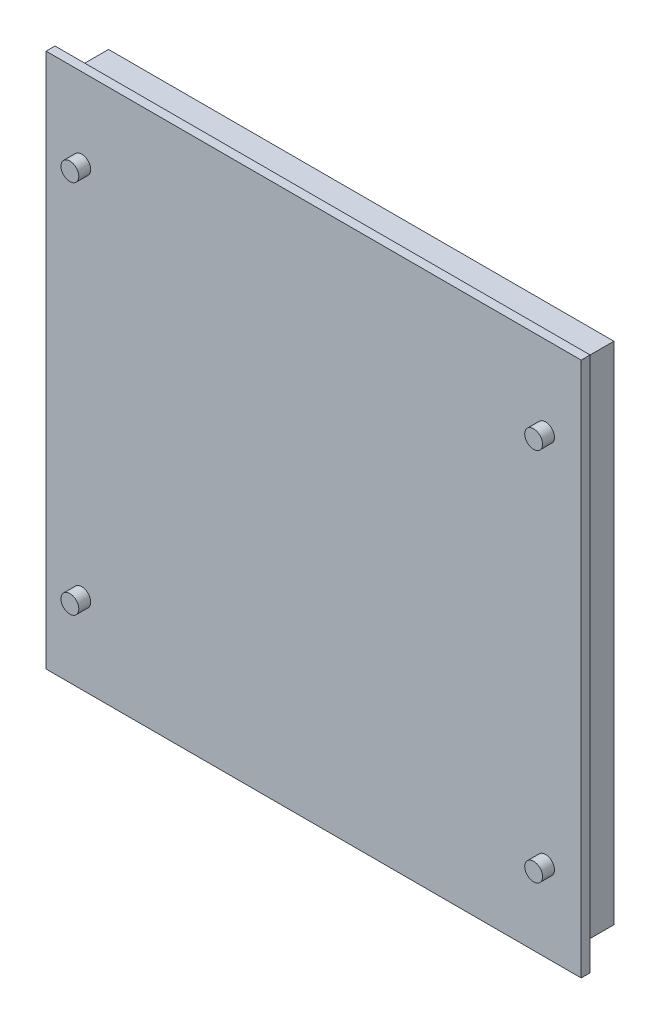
from build123d import *

# Parameters (mm, degrees)
SKETCH_1_W          = 180
SKETCH_1_H          = 180
EXTRUDE_1_DEPTH     = 3
SKETCH_2_R          = 3
EXTRUDE_2_DEPTH     = 4
SKETCH_3_W          = 170
SKETCH_3_H          = 170
EXTRUDE_3_DEPTH     = 13
CUT_EXTRUDE_1_DEPTH = 5


with BuildPart() as part:
    # Sketch 1 → Extrude 1 (new body)
    with BuildSketch(Plane.XY):
        Rectangle(SKETCH_1_W, SKETCH_1_H)
    extrude(amount=EXTRUDE_1_DEPTH)

    # Sketch 2 → Extrude 2 (add)
    with BuildSketch(Plane.XY.offset(3)):
        with Locations((-78, 63)):
            Circle(SKETCH_2_R)
        with Locations((-78, -63)):
            Circle(SKETCH_2_R)
        with Locations((78, -63)):
            Circle(SKETCH_2_R)
        with Locations((78, 63)):
            Circle(SKETCH_2_R)
    extrude(amount=EXTRUDE_2_DEPTH)

    # Sketch 3 → Extrude 3 (add)
    with BuildSketch(Plane(origin=(0, 0, 0), x_dir=(-1, 0, 0), z_dir=(0, 0, -1))):
        Rectangle(SKETCH_3_W, SKETCH_3_H)
    extrude(amount=EXTRUDE_3_DEPTH)

    # Sketch 4 → Cut-Extrude 1 (cut)
    with BuildSketch(Plane(origin=(0, 0, -13), x_dir=(-1, 0, 0), z_dir=(0, 0, -1))):
        Polygon((-6.788114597, 3.296117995), (-11.46647717, 3.296117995), (-11.46647717, -14.481659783), (-14.156535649, -14.481659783), (-14.156535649, 3.296117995), (-18.834898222, 3.296117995), (-18.834898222, 5.518340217), (-6.788114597, 5.518340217), align=None)
        Polygon((8.884400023, -14.481659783), (6.077382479, -14.481659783), (2.100774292, -6.29452528), (-1.875833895, -14.481659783), (-4.682851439, -14.481659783), (0.814224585, -3.955343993), (-4.098056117, 5.518340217), (-1.291038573, 5.518340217), (2.100774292, -1.733121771), (5.492587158, 5.518340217), (8.299604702, 5.518340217), (3.387324, -3.955343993), align=None)
        with BuildLine():
            add(Edge.make_bspline(
                [(11.22358131, -13.896864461), (11.237729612, -13.751990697), (11.265850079, -13.464046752), (11.364592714, -13.040443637), (11.503530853, -12.626856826), (11.686319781, -12.223471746), (11.912017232, -11.830124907), (12.18963069, -11.455144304), (12.49963509, -11.082002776), (12.870373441, -10.729319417), (13.270111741, -10.354063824), (13.684154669, -9.924537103), (14.132620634, -9.455598), (14.597338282, -8.92726201), (15.097929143, -8.358528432), (15.615137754, -7.732593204), (16.161317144, -7.061428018), (16.721139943, -6.357511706), (17.269747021, -5.650514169), (17.775303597, -4.965328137), (18.235066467, -4.325553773), (18.645325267, -3.728932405), (18.995148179, -3.168590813), (19.29893569, -2.653224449), (19.558147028, -2.183765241), (19.816814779, -1.623074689), (20.060945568, -0.97645104), (20.252370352, -0.241867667), (20.33935665, 0.437979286), (20.305160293, 1.062713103), (20.170874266, 1.632826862), (19.936253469, 2.150053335), (19.606998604, 2.616229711), (19.186045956, 3.013928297), (18.706210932, 3.341352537), (18.172238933, 3.561347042), (17.60089394, 3.672526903), (17.003161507, 3.662468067), (16.400669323, 3.555352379), (15.800458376, 3.369166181), (15.221849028, 3.080879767), (14.654998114, 2.721231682), (14.12980547, 2.25789624), (13.668189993, 1.687317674), (13.275501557, 1.012402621), (13.079588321, 0.513806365), (12.977967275, 0.255182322)],
                knots=[0, 0, 0, 0, 0.683264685, 1.358023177, 2.0380809, 2.730345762, 3.435487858, 4.164189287, 4.919895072, 5.711413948, 6.565494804, 7.49616148, 8.513531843, 9.613812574, 10.80147361, 12.073102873, 13.428218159, 14.866997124, 16.298560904, 17.632315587, 18.867297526, 20.000038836, 21.033387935, 21.969994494, 22.810824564, 23.551397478, 24.869445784, 26.052467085, 27.111050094, 28.075902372, 28.975949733, 29.847314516, 30.728213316, 31.639844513, 32.554273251, 33.442456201, 34.333871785, 35.270085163, 36.233696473, 37.201335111, 38.211692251, 39.261697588, 40.347896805, 41.485826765, 42.695887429, 44, 44, 44, 44], degree=3))
            Line((12.977967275, 0.255182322), (10.755745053, 0.606059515))
            add(Edge.make_bspline(
                [(10.755745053, 0.606059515), (10.834203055, 0.823591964), (10.986848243, 1.246815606), (11.249697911, 1.84946558), (11.521227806, 2.410454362), (11.808890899, 2.926064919), (12.118927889, 3.392616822), (12.443818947, 3.814645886), (12.785011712, 4.192095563), (13.143817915, 4.524524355), (13.519005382, 4.817576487), (13.913150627, 5.071720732), (14.321345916, 5.293722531), (14.745196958, 5.482132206), (15.185619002, 5.633971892), (15.644570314, 5.744391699), (16.117356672, 5.83005537), (16.440196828, 5.856051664), (16.603698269, 5.86921741)],
                knots=[0, 0, 0, 0, 1.318688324, 2.565594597, 3.747971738, 4.872722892, 5.930337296, 6.940181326, 7.908044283, 8.828858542, 9.726735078, 10.619953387, 11.500744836, 12.374616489, 13.262770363, 14.15366946, 15.064931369, 16, 16, 16, 16], degree=3))
            add(Edge.make_bspline(
                [(16.603698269, 5.86921741), (16.794162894, 5.884493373), (17.164579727, 5.914202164), (17.707497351, 5.919795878), (18.219862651, 5.884360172), (18.71074123, 5.817061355), (19.190304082, 5.698092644), (19.670905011, 5.52254544), (20.157089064, 5.28527392), (20.648065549, 4.994257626), (21.129337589, 4.638011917), (21.565054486, 4.190052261), (21.949556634, 3.65905161), (22.293099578, 3.058360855), (22.570394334, 2.383003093), (22.737159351, 1.630756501), (22.798311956, 0.814747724), (22.764710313, 0.094973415), (22.682858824, -0.514091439), (22.568175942, -1.000867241), (22.402898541, -1.507601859), (22.208302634, -2.042143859), (21.949900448, -2.591816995), (21.659050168, -3.168420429), (21.311239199, -3.761500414), (20.995603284, -4.27389208), (20.709633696, -4.70051639), (20.470109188, -5.048644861), (20.208442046, -5.420255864), (19.914742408, -5.809440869), (19.604558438, -6.225123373), (19.27090148, -6.663712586), (18.910867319, -7.121406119), (18.528620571, -7.604004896), (18.12243527, -8.110221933), (17.690478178, -8.637123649), (17.232868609, -9.183525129), (16.756727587, -9.756830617), (16.256257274, -10.352234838), (15.7310744, -10.969176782), (15.179444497, -11.604876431), (14.805864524, -12.038403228), (14.615394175, -12.259437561)],
                knots=[0, 0, 0, 0, 0.924262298, 1.797511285, 2.623724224, 3.407158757, 4.191620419, 5.009283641, 5.877881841, 6.805175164, 7.767818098, 8.765683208, 9.814991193, 10.931884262, 12.107176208, 13.332417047, 14.642951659, 16.055476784, 16.810263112, 17.613474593, 18.470705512, 19.388078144, 20.363412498, 21.406914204, 22.511682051, 23.688322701, 24.318011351, 24.996206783, 25.732766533, 26.516574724, 27.354866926, 28.242087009, 29.182574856, 30.172115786, 31.220563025, 32.322544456, 33.468316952, 34.668650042, 35.928027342, 37.231299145, 38.588373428, 40, 40, 40, 40], degree=3))
            Line((14.615394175, -12.259437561), (23.036446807, -12.259437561))
            Line((23.036446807, -12.259437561), (23.036446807, -14.364700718))
            Line((23.036446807, -14.364700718), (11.22358131, -14.364700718))
            Line((11.22358131, -14.364700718), (11.22358131, -13.896864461))
        make_face()
    extrude(amount=-CUT_EXTRUDE_1_DEPTH, mode=Mode.SUBTRACT)


solid = part.part
